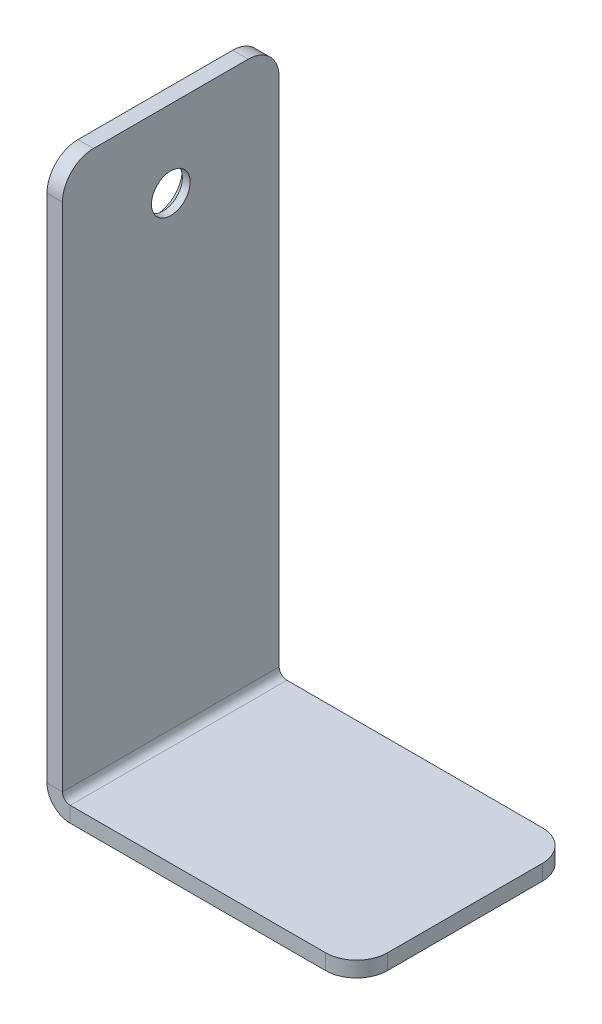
ISO-10303-21;
HEADER;
FILE_DESCRIPTION(('STEP AP214'),'2;1');
FILE_NAME('part.step','',(''),(''),'','','');
FILE_SCHEMA(('AUTOMOTIVE_DESIGN { 1 0 10303 214 1 1 1 1 }'));
ENDSEC;
DATA;
#1=APPLICATION_CONTEXT('core data for automotive mechanical design processes');
#2=APPLICATION_PROTOCOL_DEFINITION('international standard','automotive_design',2000,#1);
#3=PRODUCT_CONTEXT('',#1,'mechanical');
#4=PRODUCT('Part','Part','',(#3));
#5=PRODUCT_RELATED_PRODUCT_CATEGORY('part','',(#4));
#6=PRODUCT_DEFINITION_FORMATION('','',#4);
#7=PRODUCT_DEFINITION_CONTEXT('part definition',#1,'design');
#8=PRODUCT_DEFINITION('design','',#6,#7);
#9=PRODUCT_DEFINITION_SHAPE('','',#8);
#10=(LENGTH_UNIT() NAMED_UNIT(*) SI_UNIT(.MILLI.,.METRE.));
#11=(NAMED_UNIT(*) PLANE_ANGLE_UNIT() SI_UNIT($,.RADIAN.));
#12=(NAMED_UNIT(*) SI_UNIT($,.STERADIAN.) SOLID_ANGLE_UNIT());
#13=UNCERTAINTY_MEASURE_WITH_UNIT(LENGTH_MEASURE(1.E-05),#10,'distance_accuracy_value','');
#14=(GEOMETRIC_REPRESENTATION_CONTEXT(3) GLOBAL_UNCERTAINTY_ASSIGNED_CONTEXT((#13)) GLOBAL_UNIT_ASSIGNED_CONTEXT((#10,
#11,#12)) REPRESENTATION_CONTEXT('',''));
#15=CARTESIAN_POINT('',(0.,0.,0.));
#16=DIRECTION('',(0.,0.,1.));
#17=DIRECTION('',(1.,0.,0.));
#18=AXIS2_PLACEMENT_3D('',#15,#16,#17);
#19=CARTESIAN_POINT('',(0.,1.5,7.));
#20=DIRECTION('',(0.,0.,1.));
#21=DIRECTION('',(1.,0.,0.));
#22=AXIS2_PLACEMENT_3D('',#19,#20,#21);
#23=PLANE('',#22);
#24=DIRECTION('',(1.,0.,0.));
#25=VECTOR('',#24,1.);
#26=CARTESIAN_POINT('',(0.,1.5,7.));
#27=LINE('',#26,#25);
#28=CARTESIAN_POINT('',(0.,1.5,7.));
#29=VERTEX_POINT('',#28);
#30=CARTESIAN_POINT('',(1.,1.5,7.));
#31=VERTEX_POINT('',#30);
#32=EDGE_CURVE('E137',#29,#31,#27,.T.);
#33=ORIENTED_EDGE('',*,*,#32,.F.);
#34=CARTESIAN_POINT('',(1.5,1.5,7.));
#35=DIRECTION('',(0.,0.,-1.));
#36=DIRECTION('',(-1.,0.,0.));
#37=AXIS2_PLACEMENT_3D('',#34,#35,#36);
#38=CIRCLE('',#37,1.5);
#39=CARTESIAN_POINT('',(1.5,0.,7.));
#40=VERTEX_POINT('',#39);
#41=EDGE_CURVE('E135',#29,#40,#38,.F.);
#42=ORIENTED_EDGE('',*,*,#41,.T.);
#43=DIRECTION('',(0.,-1.,0.));
#44=VECTOR('',#43,1.);
#45=CARTESIAN_POINT('',(1.5,1.,7.));
#46=LINE('',#45,#44);
#47=CARTESIAN_POINT('',(1.5,1.,7.));
#48=VERTEX_POINT('',#47);
#49=EDGE_CURVE('E129',#48,#40,#46,.T.);
#50=ORIENTED_EDGE('',*,*,#49,.F.);
#51=CARTESIAN_POINT('',(1.5,1.5,7.));
#52=DIRECTION('',(0.,0.,1.));
#53=DIRECTION('',(1.,0.,0.));
#54=AXIS2_PLACEMENT_3D('',#51,#52,#53);
#55=CIRCLE('',#54,0.5);
#56=EDGE_CURVE('E133',#31,#48,#55,.T.);
#57=ORIENTED_EDGE('',*,*,#56,.F.);
#58=EDGE_LOOP('',(#33,#42,#50,#57));
#59=FACE_BOUND('',#58,.T.);
#60=ADVANCED_FACE('F36',(#59),#23,.T.);
#61=CARTESIAN_POINT('',(1.5,1.,7.));
#62=DIRECTION('',(0.,0.,1.));
#63=DIRECTION('',(1.,0.,0.));
#64=AXIS2_PLACEMENT_3D('',#61,#62,#63);
#65=PLANE('',#64);
#66=DIRECTION('',(0.,-1.,0.));
#67=VECTOR('',#66,1.);
#68=CARTESIAN_POINT('',(1.,36.5,7.));
#69=LINE('',#68,#67);
#70=CARTESIAN_POINT('',(1.,34.5,7.));
#71=VERTEX_POINT('',#70);
#72=EDGE_CURVE('E158',#71,#31,#69,.T.);
#73=ORIENTED_EDGE('',*,*,#72,.F.);
#74=DIRECTION('',(1.,0.,0.));
#75=VECTOR('',#74,1.);
#76=CARTESIAN_POINT('',(1.5,34.5,7.));
#77=LINE('',#76,#75);
#78=CARTESIAN_POINT('',(0.,34.5,7.));
#79=VERTEX_POINT('',#78);
#80=EDGE_CURVE('E215',#71,#79,#77,.F.);
#81=ORIENTED_EDGE('',*,*,#80,.T.);
#82=DIRECTION('',(0.,-1.,0.));
#83=VECTOR('',#82,1.);
#84=CARTESIAN_POINT('',(0.,36.5,7.));
#85=LINE('',#84,#83);
#86=EDGE_CURVE('E160',#79,#29,#85,.T.);
#87=ORIENTED_EDGE('',*,*,#86,.T.);
#88=ORIENTED_EDGE('',*,*,#32,.T.);
#89=EDGE_LOOP('',(#73,#81,#87,#88));
#90=FACE_BOUND('',#89,.T.);
#91=ADVANCED_FACE('F298',(#90),#65,.T.);
#92=CARTESIAN_POINT('',(1.5,0.,-7.));
#93=DIRECTION('',(0.,0.,-1.));
#94=DIRECTION('',(-1.,0.,0.));
#95=AXIS2_PLACEMENT_3D('',#92,#93,#94);
#96=PLANE('',#95);
#97=DIRECTION('',(0.,1.,0.));
#98=VECTOR('',#97,1.);
#99=CARTESIAN_POINT('',(1.5,0.,-7.));
#100=LINE('',#99,#98);
#101=CARTESIAN_POINT('',(1.5,0.,-7.));
#102=VERTEX_POINT('',#101);
#103=CARTESIAN_POINT('',(1.5,1.,-7.));
#104=VERTEX_POINT('',#103);
#105=EDGE_CURVE('E138',#102,#104,#100,.T.);
#106=ORIENTED_EDGE('',*,*,#105,.F.);
#107=CARTESIAN_POINT('',(1.5,1.5,-7.));
#108=DIRECTION('',(0.,0.,-1.));
#109=DIRECTION('',(-1.,0.,0.));
#110=AXIS2_PLACEMENT_3D('',#107,#108,#109);
#111=CIRCLE('',#110,1.5);
#112=CARTESIAN_POINT('',(0.,1.5,-7.));
#113=VERTEX_POINT('',#112);
#114=EDGE_CURVE('E178',#113,#102,#111,.F.);
#115=ORIENTED_EDGE('',*,*,#114,.F.);
#116=DIRECTION('',(-1.,0.,0.));
#117=VECTOR('',#116,1.);
#118=CARTESIAN_POINT('',(1.,1.5,-7.));
#119=LINE('',#118,#117);
#120=CARTESIAN_POINT('',(1.,1.5,-7.));
#121=VERTEX_POINT('',#120);
#122=EDGE_CURVE('E197',#121,#113,#119,.T.);
#123=ORIENTED_EDGE('',*,*,#122,.F.);
#124=CARTESIAN_POINT('',(1.5,1.5,-7.));
#125=DIRECTION('',(0.,0.,1.));
#126=DIRECTION('',(1.,0.,0.));
#127=AXIS2_PLACEMENT_3D('',#124,#125,#126);
#128=CIRCLE('',#127,0.5);
#129=EDGE_CURVE('E172',#121,#104,#128,.T.);
#130=ORIENTED_EDGE('',*,*,#129,.T.);
#131=EDGE_LOOP('',(#106,#115,#123,#130));
#132=FACE_BOUND('',#131,.T.);
#133=ADVANCED_FACE('F287',(#132),#96,.T.);
#134=CARTESIAN_POINT('',(1.,1.5,-7.));
#135=DIRECTION('',(0.,0.,-1.));
#136=DIRECTION('',(-1.,0.,0.));
#137=AXIS2_PLACEMENT_3D('',#134,#135,#136);
#138=PLANE('',#137);
#139=DIRECTION('',(1.,0.,0.));
#140=VECTOR('',#139,1.);
#141=CARTESIAN_POINT('',(0.,1.,-7.));
#142=LINE('',#141,#140);
#143=CARTESIAN_POINT('',(18.,1.,-7.));
#144=VERTEX_POINT('',#143);
#145=EDGE_CURVE('E145',#104,#144,#142,.T.);
#146=ORIENTED_EDGE('',*,*,#145,.T.);
#147=DIRECTION('',(0.,-1.,0.));
#148=VECTOR('',#147,1.);
#149=CARTESIAN_POINT('',(18.,1.5,-7.));
#150=LINE('',#149,#148);
#151=CARTESIAN_POINT('',(18.,0.,-7.));
#152=VERTEX_POINT('',#151);
#153=EDGE_CURVE('E11',#144,#152,#150,.T.);
#154=ORIENTED_EDGE('',*,*,#153,.T.);
#155=DIRECTION('',(1.,0.,0.));
#156=VECTOR('',#155,1.);
#157=CARTESIAN_POINT('',(0.,0.,-7.));
#158=LINE('',#157,#156);
#159=EDGE_CURVE('E167',#102,#152,#158,.T.);
#160=ORIENTED_EDGE('',*,*,#159,.F.);
#161=ORIENTED_EDGE('',*,*,#105,.T.);
#162=EDGE_LOOP('',(#146,#154,#160,#161));
#163=FACE_BOUND('',#162,.T.);
#164=ADVANCED_FACE('F290',(#163),#138,.T.);
#165=CARTESIAN_POINT('',(0.,0.,7.));
#166=DIRECTION('',(0.,1.,0.));
#167=DIRECTION('',(0.,0.,1.));
#168=AXIS2_PLACEMENT_3D('',#165,#166,#167);
#169=PLANE('',#168);
#170=DIRECTION('',(0.,0.,-1.));
#171=VECTOR('',#170,1.);
#172=CARTESIAN_POINT('',(20.,0.,7.));
#173=LINE('',#172,#171);
#174=CARTESIAN_POINT('',(20.,0.,5.));
#175=VERTEX_POINT('',#174);
#176=CARTESIAN_POINT('',(20.,0.,-5.));
#177=VERTEX_POINT('',#176);
#178=EDGE_CURVE('E194',#175,#177,#173,.T.);
#179=ORIENTED_EDGE('',*,*,#178,.F.);
#180=CARTESIAN_POINT('',(18.,0.,5.));
#181=DIRECTION('',(0.,1.,0.));
#182=DIRECTION('',(0.,0.,1.));
#183=AXIS2_PLACEMENT_3D('',#180,#181,#182);
#184=CIRCLE('',#183,2.);
#185=CARTESIAN_POINT('',(18.,0.,7.));
#186=VERTEX_POINT('',#185);
#187=EDGE_CURVE('E231',#175,#186,#184,.F.);
#188=ORIENTED_EDGE('',*,*,#187,.T.);
#189=DIRECTION('',(1.,0.,0.));
#190=VECTOR('',#189,1.);
#191=CARTESIAN_POINT('',(0.,0.,7.));
#192=LINE('',#191,#190);
#193=EDGE_CURVE('E153',#40,#186,#192,.T.);
#194=ORIENTED_EDGE('',*,*,#193,.F.);
#195=DIRECTION('',(0.,0.,-1.));
#196=VECTOR('',#195,1.);
#197=CARTESIAN_POINT('',(1.5,0.,7.));
#198=LINE('',#197,#196);
#199=EDGE_CURVE('E166',#40,#102,#198,.T.);
#200=ORIENTED_EDGE('',*,*,#199,.T.);
#201=ORIENTED_EDGE('',*,*,#159,.T.);
#202=CARTESIAN_POINT('',(18.,0.,-5.));
#203=DIRECTION('',(0.,1.,0.));
#204=DIRECTION('',(0.,0.,1.));
#205=AXIS2_PLACEMENT_3D('',#202,#203,#204);
#206=CIRCLE('',#205,2.);
#207=EDGE_CURVE('E229',#152,#177,#206,.F.);
#208=ORIENTED_EDGE('',*,*,#207,.T.);
#209=EDGE_LOOP('',(#179,#188,#194,#200,#201,#208));
#210=FACE_BOUND('',#209,.T.);
#211=ADVANCED_FACE('F244',(#210),#169,.F.);
#212=CARTESIAN_POINT('',(20.,1.,7.));
#213=DIRECTION('',(1.,0.,0.));
#214=DIRECTION('',(0.,0.,-1.));
#215=AXIS2_PLACEMENT_3D('',#212,#213,#214);
#216=PLANE('',#215);
#217=DIRECTION('',(0.,0.,-1.));
#218=VECTOR('',#217,1.);
#219=CARTESIAN_POINT('',(20.,1.,7.));
#220=LINE('',#219,#218);
#221=CARTESIAN_POINT('',(20.,1.,5.));
#222=VERTEX_POINT('',#221);
#223=CARTESIAN_POINT('',(20.,1.,-5.));
#224=VERTEX_POINT('',#223);
#225=EDGE_CURVE('E149',#222,#224,#220,.T.);
#226=ORIENTED_EDGE('',*,*,#225,.F.);
#227=DIRECTION('',(0.,-1.,0.));
#228=VECTOR('',#227,1.);
#229=CARTESIAN_POINT('',(20.,1.,5.));
#230=LINE('',#229,#228);
#231=EDGE_CURVE('E226',#222,#175,#230,.T.);
#232=ORIENTED_EDGE('',*,*,#231,.T.);
#233=ORIENTED_EDGE('',*,*,#178,.T.);
#234=DIRECTION('',(0.,-1.,0.));
#235=VECTOR('',#234,1.);
#236=CARTESIAN_POINT('',(20.,1.,-5.));
#237=LINE('',#236,#235);
#238=EDGE_CURVE('E224',#177,#224,#237,.F.);
#239=ORIENTED_EDGE('',*,*,#238,.T.);
#240=EDGE_LOOP('',(#226,#232,#233,#239));
#241=FACE_BOUND('',#240,.T.);
#242=ADVANCED_FACE('F238',(#241),#216,.T.);
#243=CARTESIAN_POINT('',(0.,1.,7.));
#244=DIRECTION('',(0.,1.,0.));
#245=DIRECTION('',(0.,0.,1.));
#246=AXIS2_PLACEMENT_3D('',#243,#244,#245);
#247=PLANE('',#246);
#248=DIRECTION('',(1.,0.,0.));
#249=VECTOR('',#248,1.);
#250=CARTESIAN_POINT('',(0.,1.,7.));
#251=LINE('',#250,#249);
#252=CARTESIAN_POINT('',(18.,1.,7.));
#253=VERTEX_POINT('',#252);
#254=EDGE_CURVE('E143',#48,#253,#251,.T.);
#255=ORIENTED_EDGE('',*,*,#254,.T.);
#256=CARTESIAN_POINT('',(18.,1.,5.));
#257=DIRECTION('',(0.,1.,0.));
#258=DIRECTION('',(0.,0.,1.));
#259=AXIS2_PLACEMENT_3D('',#256,#257,#258);
#260=CIRCLE('',#259,2.);
#261=EDGE_CURVE('E44',#253,#222,#260,.T.);
#262=ORIENTED_EDGE('',*,*,#261,.T.);
#263=ORIENTED_EDGE('',*,*,#225,.T.);
#264=CARTESIAN_POINT('',(18.,1.,-5.));
#265=DIRECTION('',(0.,1.,0.));
#266=DIRECTION('',(0.,0.,1.));
#267=AXIS2_PLACEMENT_3D('',#264,#265,#266);
#268=CIRCLE('',#267,2.);
#269=EDGE_CURVE('E51',#224,#144,#268,.T.);
#270=ORIENTED_EDGE('',*,*,#269,.T.);
#271=ORIENTED_EDGE('',*,*,#145,.F.);
#272=DIRECTION('',(0.,0.,-1.));
#273=VECTOR('',#272,1.);
#274=CARTESIAN_POINT('',(1.5,1.,7.));
#275=LINE('',#274,#273);
#276=EDGE_CURVE('E141',#48,#104,#275,.T.);
#277=ORIENTED_EDGE('',*,*,#276,.F.);
#278=EDGE_LOOP('',(#255,#262,#263,#270,#271,#277));
#279=FACE_BOUND('',#278,.T.);
#280=ADVANCED_FACE('F142',(#279),#247,.T.);
#281=CARTESIAN_POINT('',(1.5,1.5,7.));
#282=DIRECTION('',(0.,0.,-1.));
#283=DIRECTION('',(-1.,0.,0.));
#284=AXIS2_PLACEMENT_3D('',#281,#282,#283);
#285=CYLINDRICAL_SURFACE('',#284,0.5);
#286=ORIENTED_EDGE('',*,*,#129,.F.);
#287=DIRECTION('',(0.,0.,-1.));
#288=VECTOR('',#287,1.);
#289=CARTESIAN_POINT('',(1.,1.5,7.));
#290=LINE('',#289,#288);
#291=EDGE_CURVE('E150',#31,#121,#290,.T.);
#292=ORIENTED_EDGE('',*,*,#291,.F.);
#293=ORIENTED_EDGE('',*,*,#56,.T.);
#294=ORIENTED_EDGE('',*,*,#276,.T.);
#295=EDGE_LOOP('',(#286,#292,#293,#294));
#296=FACE_BOUND('',#295,.T.);
#297=ADVANCED_FACE('F156',(#296),#285,.F.);
#298=CARTESIAN_POINT('',(1.,36.5,7.));
#299=DIRECTION('',(1.,0.,0.));
#300=DIRECTION('',(0.,1.,0.));
#301=AXIS2_PLACEMENT_3D('',#298,#299,#300);
#302=PLANE('',#301);
#303=CARTESIAN_POINT('',(1.,31.5,0.));
#304=DIRECTION('',(1.,0.,0.));
#305=DIRECTION('',(0.,1.,0.));
#306=AXIS2_PLACEMENT_3D('',#303,#304,#305);
#307=CIRCLE('',#306,1.24999999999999);
#308=CARTESIAN_POINT('',(1.,32.75,0.));
#309=VERTEX_POINT('',#308);
#310=EDGE_CURVE('E170',#309,#309,#307,.T.);
#311=ORIENTED_EDGE('',*,*,#310,.F.);
#312=EDGE_LOOP('',(#311));
#313=FACE_BOUND('',#312,.T.);
#314=DIRECTION('',(0.,0.,-1.));
#315=VECTOR('',#314,1.);
#316=CARTESIAN_POINT('',(1.,36.5,7.));
#317=LINE('',#316,#315);
#318=CARTESIAN_POINT('',(1.,36.5,5.));
#319=VERTEX_POINT('',#318);
#320=CARTESIAN_POINT('',(1.,36.5,-5.));
#321=VERTEX_POINT('',#320);
#322=EDGE_CURVE('E189',#319,#321,#317,.T.);
#323=ORIENTED_EDGE('',*,*,#322,.F.);
#324=CARTESIAN_POINT('',(1.,34.5,5.));
#325=DIRECTION('',(1.,0.,0.));
#326=DIRECTION('',(0.,1.,0.));
#327=AXIS2_PLACEMENT_3D('',#324,#325,#326);
#328=CIRCLE('',#327,2.);
#329=EDGE_CURVE('E213',#319,#71,#328,.T.);
#330=ORIENTED_EDGE('',*,*,#329,.T.);
#331=ORIENTED_EDGE('',*,*,#72,.T.);
#332=ORIENTED_EDGE('',*,*,#291,.T.);
#333=DIRECTION('',(0.,-1.,0.));
#334=VECTOR('',#333,1.);
#335=CARTESIAN_POINT('',(1.,36.5,-7.));
#336=LINE('',#335,#334);
#337=CARTESIAN_POINT('',(1.,34.5,-7.));
#338=VERTEX_POINT('',#337);
#339=EDGE_CURVE('E174',#338,#121,#336,.T.);
#340=ORIENTED_EDGE('',*,*,#339,.F.);
#341=CARTESIAN_POINT('',(1.,34.5,-5.));
#342=DIRECTION('',(1.,0.,0.));
#343=DIRECTION('',(0.,1.,0.));
#344=AXIS2_PLACEMENT_3D('',#341,#342,#343);
#345=CIRCLE('',#344,2.);
#346=EDGE_CURVE('E211',#338,#321,#345,.T.);
#347=ORIENTED_EDGE('',*,*,#346,.T.);
#348=EDGE_LOOP('',(#323,#330,#331,#332,#340,#347));
#349=FACE_BOUND('',#348,.T.);
#350=ADVANCED_FACE('F273',(#313,#349),#302,.T.);
#351=CARTESIAN_POINT('',(0.,36.5,7.));
#352=DIRECTION('',(0.,1.,0.));
#353=DIRECTION('',(0.,0.,1.));
#354=AXIS2_PLACEMENT_3D('',#351,#352,#353);
#355=PLANE('',#354);
#356=DIRECTION('',(0.,0.,-1.));
#357=VECTOR('',#356,1.);
#358=CARTESIAN_POINT('',(0.,36.5,7.));
#359=LINE('',#358,#357);
#360=CARTESIAN_POINT('',(0.,36.5,5.));
#361=VERTEX_POINT('',#360);
#362=CARTESIAN_POINT('',(0.,36.5,-5.));
#363=VERTEX_POINT('',#362);
#364=EDGE_CURVE('E186',#361,#363,#359,.T.);
#365=ORIENTED_EDGE('',*,*,#364,.F.);
#366=DIRECTION('',(1.,0.,0.));
#367=VECTOR('',#366,1.);
#368=CARTESIAN_POINT('',(0.,36.5,5.));
#369=LINE('',#368,#367);
#370=EDGE_CURVE('E208',#361,#319,#369,.T.);
#371=ORIENTED_EDGE('',*,*,#370,.T.);
#372=ORIENTED_EDGE('',*,*,#322,.T.);
#373=DIRECTION('',(1.,0.,0.));
#374=VECTOR('',#373,1.);
#375=CARTESIAN_POINT('',(0.,36.5,-5.));
#376=LINE('',#375,#374);
#377=EDGE_CURVE('E203',#321,#363,#376,.F.);
#378=ORIENTED_EDGE('',*,*,#377,.T.);
#379=EDGE_LOOP('',(#365,#371,#372,#378));
#380=FACE_BOUND('',#379,.T.);
#381=ADVANCED_FACE('F258',(#380),#355,.T.);
#382=CARTESIAN_POINT('',(0.,36.5,7.));
#383=DIRECTION('',(1.,0.,0.));
#384=DIRECTION('',(0.,1.,0.));
#385=AXIS2_PLACEMENT_3D('',#382,#383,#384);
#386=PLANE('',#385);
#387=CARTESIAN_POINT('',(0.,31.5,0.));
#388=DIRECTION('',(-1.,0.,0.));
#389=DIRECTION('',(0.,0.,1.));
#390=AXIS2_PLACEMENT_3D('',#387,#388,#389);
#391=CIRCLE('',#390,1.75);
#392=CARTESIAN_POINT('',(0.,31.5,1.75000000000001));
#393=VERTEX_POINT('',#392);
#394=EDGE_CURVE('E248',#393,#393,#391,.T.);
#395=ORIENTED_EDGE('',*,*,#394,.F.);
#396=EDGE_LOOP('',(#395));
#397=FACE_BOUND('',#396,.T.);
#398=ORIENTED_EDGE('',*,*,#86,.F.);
#399=CARTESIAN_POINT('',(0.,34.5,5.));
#400=DIRECTION('',(1.,0.,0.));
#401=DIRECTION('',(0.,1.,0.));
#402=AXIS2_PLACEMENT_3D('',#399,#400,#401);
#403=CIRCLE('',#402,2.);
#404=EDGE_CURVE('E219',#79,#361,#403,.F.);
#405=ORIENTED_EDGE('',*,*,#404,.T.);
#406=ORIENTED_EDGE('',*,*,#364,.T.);
#407=CARTESIAN_POINT('',(0.,34.5,-5.));
#408=DIRECTION('',(1.,0.,0.));
#409=DIRECTION('',(0.,1.,0.));
#410=AXIS2_PLACEMENT_3D('',#407,#408,#409);
#411=CIRCLE('',#410,2.);
#412=CARTESIAN_POINT('',(0.,34.5,-7.));
#413=VERTEX_POINT('',#412);
#414=EDGE_CURVE('E217',#363,#413,#411,.F.);
#415=ORIENTED_EDGE('',*,*,#414,.T.);
#416=DIRECTION('',(0.,-1.,0.));
#417=VECTOR('',#416,1.);
#418=CARTESIAN_POINT('',(0.,36.5,-7.));
#419=LINE('',#418,#417);
#420=EDGE_CURVE('E176',#413,#113,#419,.T.);
#421=ORIENTED_EDGE('',*,*,#420,.T.);
#422=DIRECTION('',(0.,0.,-1.));
#423=VECTOR('',#422,1.);
#424=CARTESIAN_POINT('',(0.,1.5,7.));
#425=LINE('',#424,#423);
#426=EDGE_CURVE('E183',#29,#113,#425,.T.);
#427=ORIENTED_EDGE('',*,*,#426,.F.);
#428=EDGE_LOOP('',(#398,#405,#406,#415,#421,#427));
#429=FACE_BOUND('',#428,.T.);
#430=ADVANCED_FACE('F254',(#397,#429),#386,.F.);
#431=CARTESIAN_POINT('',(1.5,1.5,7.));
#432=DIRECTION('',(0.,0.,-1.));
#433=DIRECTION('',(-1.,0.,0.));
#434=AXIS2_PLACEMENT_3D('',#431,#432,#433);
#435=CYLINDRICAL_SURFACE('',#434,1.5);
#436=ORIENTED_EDGE('',*,*,#114,.T.);
#437=ORIENTED_EDGE('',*,*,#199,.F.);
#438=ORIENTED_EDGE('',*,*,#41,.F.);
#439=ORIENTED_EDGE('',*,*,#426,.T.);
#440=EDGE_LOOP('',(#436,#437,#438,#439));
#441=FACE_BOUND('',#440,.T.);
#442=ADVANCED_FACE('F257',(#441),#435,.T.);
#443=CARTESIAN_POINT('',(1.5,1.5,7.));
#444=DIRECTION('',(0.,0.,1.));
#445=DIRECTION('',(1.,0.,0.));
#446=AXIS2_PLACEMENT_3D('',#443,#444,#445);
#447=PLANE('',#446);
#448=ORIENTED_EDGE('',*,*,#193,.T.);
#449=DIRECTION('',(0.,-1.,0.));
#450=VECTOR('',#449,1.);
#451=CARTESIAN_POINT('',(18.,1.5,7.));
#452=LINE('',#451,#450);
#453=EDGE_CURVE('E59',#186,#253,#452,.F.);
#454=ORIENTED_EDGE('',*,*,#453,.T.);
#455=ORIENTED_EDGE('',*,*,#254,.F.);
#456=ORIENTED_EDGE('',*,*,#49,.T.);
#457=EDGE_LOOP('',(#448,#454,#455,#456));
#458=FACE_BOUND('',#457,.T.);
#459=ADVANCED_FACE('F152',(#458),#447,.T.);
#460=CARTESIAN_POINT('',(1.5,1.5,-7.));
#461=DIRECTION('',(0.,0.,1.));
#462=DIRECTION('',(1.,0.,0.));
#463=AXIS2_PLACEMENT_3D('',#460,#461,#462);
#464=PLANE('',#463);
#465=ORIENTED_EDGE('',*,*,#420,.F.);
#466=DIRECTION('',(1.,0.,0.));
#467=VECTOR('',#466,1.);
#468=CARTESIAN_POINT('',(1.,34.5,-7.));
#469=LINE('',#468,#467);
#470=EDGE_CURVE('E221',#413,#338,#469,.T.);
#471=ORIENTED_EDGE('',*,*,#470,.T.);
#472=ORIENTED_EDGE('',*,*,#339,.T.);
#473=ORIENTED_EDGE('',*,*,#122,.T.);
#474=EDGE_LOOP('',(#465,#471,#472,#473));
#475=FACE_BOUND('',#474,.T.);
#476=ADVANCED_FACE('F282',(#475),#464,.F.);
#477=CARTESIAN_POINT('',(0.,31.5,0.));
#478=DIRECTION('',(-1.,0.,0.));
#479=DIRECTION('',(0.,0.,1.));
#480=AXIS2_PLACEMENT_3D('',#477,#478,#479);
#481=CYLINDRICAL_SURFACE('',#480,1.24999999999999);
#482=ORIENTED_EDGE('',*,*,#310,.T.);
#483=EDGE_LOOP('',(#482));
#484=FACE_BOUND('',#483,.T.);
#485=CARTESIAN_POINT('',(0.500000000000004,31.5,0.));
#486=DIRECTION('',(-1.,0.,0.));
#487=DIRECTION('',(0.,0.,1.));
#488=AXIS2_PLACEMENT_3D('',#485,#486,#487);
#489=CIRCLE('',#488,1.24999999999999);
#490=CARTESIAN_POINT('',(0.500000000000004,31.5,1.25));
#491=VERTEX_POINT('',#490);
#492=EDGE_CURVE('E206',#491,#491,#489,.T.);
#493=ORIENTED_EDGE('',*,*,#492,.T.);
#494=EDGE_LOOP('',(#493));
#495=FACE_BOUND('',#494,.T.);
#496=ADVANCED_FACE('F338',(#484,#495),#481,.F.);
#497=CARTESIAN_POINT('',(0.,31.5,0.));
#498=DIRECTION('',(-1.,0.,0.));
#499=DIRECTION('',(0.,0.,1.));
#500=AXIS2_PLACEMENT_3D('',#497,#498,#499);
#501=CONICAL_SURFACE('',#500,1.75,0.785398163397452);
#502=ORIENTED_EDGE('',*,*,#492,.F.);
#503=EDGE_LOOP('',(#502));
#504=FACE_BOUND('',#503,.T.);
#505=ORIENTED_EDGE('',*,*,#394,.T.);
#506=EDGE_LOOP('',(#505));
#507=FACE_BOUND('',#506,.T.);
#508=ADVANCED_FACE('F252',(#504,#507),#501,.F.);
#509=CARTESIAN_POINT('',(0.,34.5,5.));
#510=DIRECTION('',(1.,0.,0.));
#511=DIRECTION('',(0.,0.,-1.));
#512=AXIS2_PLACEMENT_3D('',#509,#510,#511);
#513=CYLINDRICAL_SURFACE('',#512,2.);
#514=ORIENTED_EDGE('',*,*,#404,.F.);
#515=ORIENTED_EDGE('',*,*,#80,.F.);
#516=ORIENTED_EDGE('',*,*,#329,.F.);
#517=ORIENTED_EDGE('',*,*,#370,.F.);
#518=EDGE_LOOP('',(#514,#515,#516,#517));
#519=FACE_BOUND('',#518,.T.);
#520=ADVANCED_FACE('F268',(#519),#513,.T.);
#521=CARTESIAN_POINT('',(1.5,34.5,-5.));
#522=DIRECTION('',(-1.,0.,0.));
#523=DIRECTION('',(0.,0.,1.));
#524=AXIS2_PLACEMENT_3D('',#521,#522,#523);
#525=CYLINDRICAL_SURFACE('',#524,2.);
#526=ORIENTED_EDGE('',*,*,#414,.F.);
#527=ORIENTED_EDGE('',*,*,#377,.F.);
#528=ORIENTED_EDGE('',*,*,#346,.F.);
#529=ORIENTED_EDGE('',*,*,#470,.F.);
#530=EDGE_LOOP('',(#526,#527,#528,#529));
#531=FACE_BOUND('',#530,.T.);
#532=ADVANCED_FACE('F279',(#531),#525,.T.);
#533=CARTESIAN_POINT('',(18.,1.,5.));
#534=DIRECTION('',(0.,-1.,0.));
#535=DIRECTION('',(0.,0.,-1.));
#536=AXIS2_PLACEMENT_3D('',#533,#534,#535);
#537=CYLINDRICAL_SURFACE('',#536,2.);
#538=ORIENTED_EDGE('',*,*,#261,.F.);
#539=ORIENTED_EDGE('',*,*,#453,.F.);
#540=ORIENTED_EDGE('',*,*,#187,.F.);
#541=ORIENTED_EDGE('',*,*,#231,.F.);
#542=EDGE_LOOP('',(#538,#539,#540,#541));
#543=FACE_BOUND('',#542,.T.);
#544=ADVANCED_FACE('F241',(#543),#537,.T.);
#545=CARTESIAN_POINT('',(18.,1.5,-5.));
#546=DIRECTION('',(0.,-1.,0.));
#547=DIRECTION('',(0.,0.,-1.));
#548=AXIS2_PLACEMENT_3D('',#545,#546,#547);
#549=CYLINDRICAL_SURFACE('',#548,2.);
#550=ORIENTED_EDGE('',*,*,#269,.F.);
#551=ORIENTED_EDGE('',*,*,#238,.F.);
#552=ORIENTED_EDGE('',*,*,#207,.F.);
#553=ORIENTED_EDGE('',*,*,#153,.F.);
#554=EDGE_LOOP('',(#550,#551,#552,#553));
#555=FACE_BOUND('',#554,.T.);
#556=ADVANCED_FACE('F38',(#555),#549,.T.);
#557=CLOSED_SHELL('',(#60,#91,#133,#164,#211,#242,#280,#297,#350,#381,#430,#442,#459,#476,#496,
#508,#520,#532,#544,#556));
#558=MANIFOLD_SOLID_BREP('B2',#557);
#559=ADVANCED_BREP_SHAPE_REPRESENTATION('',(#18,#558),#14);
#560=SHAPE_DEFINITION_REPRESENTATION(#9,#559);
ENDSEC;
END-ISO-10303-21;
